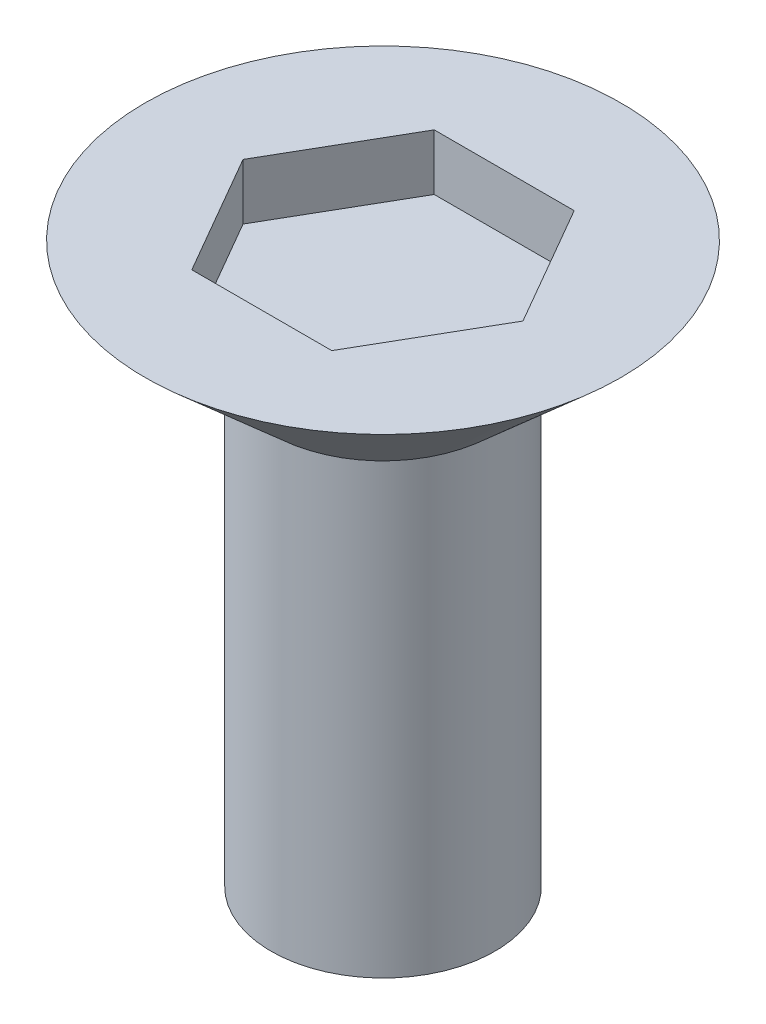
ISO-10303-21;
HEADER;
FILE_DESCRIPTION(('STEP AP214'),'2;1');
FILE_NAME('part.step','',(''),(''),'','','');
FILE_SCHEMA(('AUTOMOTIVE_DESIGN { 1 0 10303 214 1 1 1 1 }'));
ENDSEC;
DATA;
#1=APPLICATION_CONTEXT('core data for automotive mechanical design processes');
#2=APPLICATION_PROTOCOL_DEFINITION('international standard','automotive_design',2000,#1);
#3=PRODUCT_CONTEXT('',#1,'mechanical');
#4=PRODUCT('Part','Part','',(#3));
#5=PRODUCT_RELATED_PRODUCT_CATEGORY('part','',(#4));
#6=PRODUCT_DEFINITION_FORMATION('','',#4);
#7=PRODUCT_DEFINITION_CONTEXT('part definition',#1,'design');
#8=PRODUCT_DEFINITION('design','',#6,#7);
#9=PRODUCT_DEFINITION_SHAPE('','',#8);
#10=(LENGTH_UNIT() NAMED_UNIT(*) SI_UNIT(.MILLI.,.METRE.));
#11=(NAMED_UNIT(*) PLANE_ANGLE_UNIT() SI_UNIT($,.RADIAN.));
#12=(NAMED_UNIT(*) SI_UNIT($,.STERADIAN.) SOLID_ANGLE_UNIT());
#13=UNCERTAINTY_MEASURE_WITH_UNIT(LENGTH_MEASURE(1.E-05),#10,'distance_accuracy_value','');
#14=(GEOMETRIC_REPRESENTATION_CONTEXT(3) GLOBAL_UNCERTAINTY_ASSIGNED_CONTEXT((#13)) GLOBAL_UNIT_ASSIGNED_CONTEXT((#10,
#11,#12)) REPRESENTATION_CONTEXT('',''));
#15=CARTESIAN_POINT('',(0.,0.,0.));
#16=DIRECTION('',(0.,0.,1.));
#17=DIRECTION('',(1.,0.,0.));
#18=AXIS2_PLACEMENT_3D('',#15,#16,#17);
#19=CARTESIAN_POINT('',(0.,20.,0.));
#20=DIRECTION('',(0.,1.,0.));
#21=DIRECTION('',(-1.,0.,0.));
#22=AXIS2_PLACEMENT_3D('',#19,#20,#21);
#23=CONICAL_SURFACE('',#22,8.49999999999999,0.84415398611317);
#24=CARTESIAN_POINT('',(0.,16.,0.));
#25=DIRECTION('',(0.,1.,0.));
#26=DIRECTION('',(-1.,0.,0.));
#27=AXIS2_PLACEMENT_3D('',#24,#25,#26);
#28=CIRCLE('',#27,3.99999999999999);
#29=CARTESIAN_POINT('',(-4.,16.,0.));
#30=VERTEX_POINT('',#29);
#31=EDGE_CURVE('E131',#30,#30,#28,.T.);
#32=ORIENTED_EDGE('',*,*,#31,.T.);
#33=EDGE_LOOP('',(#32));
#34=FACE_BOUND('',#33,.T.);
#35=CARTESIAN_POINT('',(0.,20.,0.));
#36=DIRECTION('',(0.,1.,0.));
#37=DIRECTION('',(-1.,0.,0.));
#38=AXIS2_PLACEMENT_3D('',#35,#36,#37);
#39=CIRCLE('',#38,8.49999999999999);
#40=CARTESIAN_POINT('',(-8.5,20.,0.));
#41=VERTEX_POINT('',#40);
#42=EDGE_CURVE('E11',#41,#41,#39,.T.);
#43=ORIENTED_EDGE('',*,*,#42,.F.);
#44=EDGE_LOOP('',(#43));
#45=FACE_BOUND('',#44,.T.);
#46=ADVANCED_FACE('F30',(#34,#45),#23,.T.);
#47=CARTESIAN_POINT('',(-8.5,20.,0.));
#48=DIRECTION('',(0.,1.,0.));
#49=DIRECTION('',(-1.,0.,0.));
#50=AXIS2_PLACEMENT_3D('',#47,#48,#49);
#51=PLANE('',#50);
#52=DIRECTION('',(0.5,0.,0.866025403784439));
#53=VECTOR('',#52,1.);
#54=CARTESIAN_POINT('',(-2.50000000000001,20.,4.33012701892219));
#55=LINE('',#54,#53);
#56=CARTESIAN_POINT('',(-5.00000000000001,20.,0.));
#57=VERTEX_POINT('',#56);
#58=CARTESIAN_POINT('',(-2.50000000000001,20.,4.33012701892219));
#59=VERTEX_POINT('',#58);
#60=EDGE_CURVE('E44',#57,#59,#55,.T.);
#61=ORIENTED_EDGE('',*,*,#60,.F.);
#62=DIRECTION('',(-0.5,0.,0.866025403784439));
#63=VECTOR('',#62,1.);
#64=CARTESIAN_POINT('',(-5.00000000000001,20.,0.));
#65=LINE('',#64,#63);
#66=CARTESIAN_POINT('',(-2.50000000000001,20.,-4.33012701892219));
#67=VERTEX_POINT('',#66);
#68=EDGE_CURVE('E127',#67,#57,#65,.T.);
#69=ORIENTED_EDGE('',*,*,#68,.F.);
#70=DIRECTION('',(-1.,0.,0.));
#71=VECTOR('',#70,1.);
#72=CARTESIAN_POINT('',(-2.50000000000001,20.,-4.33012701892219));
#73=LINE('',#72,#71);
#74=CARTESIAN_POINT('',(2.49999999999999,20.,-4.33012701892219));
#75=VERTEX_POINT('',#74);
#76=EDGE_CURVE('E125',#75,#67,#73,.T.);
#77=ORIENTED_EDGE('',*,*,#76,.F.);
#78=DIRECTION('',(-0.5,0.,-0.866025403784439));
#79=VECTOR('',#78,1.);
#80=CARTESIAN_POINT('',(2.49999999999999,20.,-4.33012701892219));
#81=LINE('',#80,#79);
#82=CARTESIAN_POINT('',(4.99999999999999,20.,0.));
#83=VERTEX_POINT('',#82);
#84=EDGE_CURVE('E92',#83,#75,#81,.T.);
#85=ORIENTED_EDGE('',*,*,#84,.F.);
#86=DIRECTION('',(0.5,0.,-0.866025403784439));
#87=VECTOR('',#86,1.);
#88=CARTESIAN_POINT('',(4.99999999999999,20.,0.));
#89=LINE('',#88,#87);
#90=CARTESIAN_POINT('',(2.49999999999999,20.,4.33012701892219));
#91=VERTEX_POINT('',#90);
#92=EDGE_CURVE('E121',#91,#83,#89,.T.);
#93=ORIENTED_EDGE('',*,*,#92,.F.);
#94=DIRECTION('',(1.,0.,0.));
#95=VECTOR('',#94,1.);
#96=CARTESIAN_POINT('',(2.49999999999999,20.,4.33012701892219));
#97=LINE('',#96,#95);
#98=EDGE_CURVE('E118',#59,#91,#97,.T.);
#99=ORIENTED_EDGE('',*,*,#98,.F.);
#100=EDGE_LOOP('',(#61,#69,#77,#85,#93,#99));
#101=FACE_BOUND('',#100,.T.);
#102=ORIENTED_EDGE('',*,*,#42,.T.);
#103=EDGE_LOOP('',(#102));
#104=FACE_BOUND('',#103,.T.);
#105=ADVANCED_FACE('F146',(#101,#104),#51,.T.);
#106=CARTESIAN_POINT('',(-4.,0.,0.));
#107=DIRECTION('',(0.,-1.,0.));
#108=DIRECTION('',(1.,0.,0.));
#109=AXIS2_PLACEMENT_3D('',#106,#107,#108);
#110=PLANE('',#109);
#111=CARTESIAN_POINT('',(0.,0.,0.));
#112=DIRECTION('',(0.,1.,0.));
#113=DIRECTION('',(-1.,0.,0.));
#114=AXIS2_PLACEMENT_3D('',#111,#112,#113);
#115=CIRCLE('',#114,4.);
#116=CARTESIAN_POINT('',(-4.,0.,0.));
#117=VERTEX_POINT('',#116);
#118=EDGE_CURVE('E37',#117,#117,#115,.T.);
#119=ORIENTED_EDGE('',*,*,#118,.F.);
#120=EDGE_LOOP('',(#119));
#121=FACE_BOUND('',#120,.T.);
#122=ADVANCED_FACE('F144',(#121),#110,.T.);
#123=CARTESIAN_POINT('',(0.,20.,0.));
#124=DIRECTION('',(0.,1.,0.));
#125=DIRECTION('',(-1.,0.,0.));
#126=AXIS2_PLACEMENT_3D('',#123,#124,#125);
#127=CYLINDRICAL_SURFACE('',#126,4.);
#128=ORIENTED_EDGE('',*,*,#118,.T.);
#129=EDGE_LOOP('',(#128));
#130=FACE_BOUND('',#129,.T.);
#131=ORIENTED_EDGE('',*,*,#31,.F.);
#132=EDGE_LOOP('',(#131));
#133=FACE_BOUND('',#132,.T.);
#134=ADVANCED_FACE('F141',(#130,#133),#127,.T.);
#135=CARTESIAN_POINT('',(-2.50000000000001,18.,4.33012701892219));
#136=DIRECTION('',(-0.866025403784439,0.,0.5));
#137=DIRECTION('',(0.5,0.,0.866025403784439));
#138=AXIS2_PLACEMENT_3D('',#135,#136,#137);
#139=PLANE('',#138);
#140=ORIENTED_EDGE('',*,*,#60,.T.);
#141=DIRECTION('',(0.,1.,0.));
#142=VECTOR('',#141,1.);
#143=CARTESIAN_POINT('',(-2.50000000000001,18.,4.33012701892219));
#144=LINE('',#143,#142);
#145=CARTESIAN_POINT('',(-2.50000000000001,18.,4.33012701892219));
#146=VERTEX_POINT('',#145);
#147=EDGE_CURVE('E74',#146,#59,#144,.T.);
#148=ORIENTED_EDGE('',*,*,#147,.F.);
#149=DIRECTION('',(0.5,0.,0.866025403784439));
#150=VECTOR('',#149,1.);
#151=CARTESIAN_POINT('',(-2.50000000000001,18.,4.33012701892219));
#152=LINE('',#151,#150);
#153=CARTESIAN_POINT('',(-5.00000000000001,18.,0.));
#154=VERTEX_POINT('',#153);
#155=EDGE_CURVE('E129',#154,#146,#152,.T.);
#156=ORIENTED_EDGE('',*,*,#155,.F.);
#157=DIRECTION('',(0.,1.,0.));
#158=VECTOR('',#157,1.);
#159=CARTESIAN_POINT('',(-5.00000000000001,18.,0.));
#160=LINE('',#159,#158);
#161=EDGE_CURVE('E52',#154,#57,#160,.T.);
#162=ORIENTED_EDGE('',*,*,#161,.T.);
#163=EDGE_LOOP('',(#140,#148,#156,#162));
#164=FACE_BOUND('',#163,.T.);
#165=ADVANCED_FACE('F152',(#164),#139,.F.);
#166=CARTESIAN_POINT('',(-5.00000000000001,18.,0.));
#167=DIRECTION('',(-0.866025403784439,0.,-0.5));
#168=DIRECTION('',(-0.5,0.,0.866025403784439));
#169=AXIS2_PLACEMENT_3D('',#166,#167,#168);
#170=PLANE('',#169);
#171=ORIENTED_EDGE('',*,*,#68,.T.);
#172=ORIENTED_EDGE('',*,*,#161,.F.);
#173=DIRECTION('',(-0.5,0.,0.866025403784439));
#174=VECTOR('',#173,1.);
#175=CARTESIAN_POINT('',(-5.00000000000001,18.,0.));
#176=LINE('',#175,#174);
#177=CARTESIAN_POINT('',(-2.50000000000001,18.,-4.33012701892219));
#178=VERTEX_POINT('',#177);
#179=EDGE_CURVE('E104',#178,#154,#176,.T.);
#180=ORIENTED_EDGE('',*,*,#179,.F.);
#181=DIRECTION('',(0.,1.,0.));
#182=VECTOR('',#181,1.);
#183=CARTESIAN_POINT('',(-2.50000000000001,18.,-4.33012701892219));
#184=LINE('',#183,#182);
#185=EDGE_CURVE('E96',#178,#67,#184,.T.);
#186=ORIENTED_EDGE('',*,*,#185,.T.);
#187=EDGE_LOOP('',(#171,#172,#180,#186));
#188=FACE_BOUND('',#187,.T.);
#189=ADVANCED_FACE('F180',(#188),#170,.F.);
#190=CARTESIAN_POINT('',(-2.50000000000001,18.,-4.33012701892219));
#191=DIRECTION('',(0.,0.,-1.));
#192=DIRECTION('',(-1.,0.,0.));
#193=AXIS2_PLACEMENT_3D('',#190,#191,#192);
#194=PLANE('',#193);
#195=ORIENTED_EDGE('',*,*,#76,.T.);
#196=ORIENTED_EDGE('',*,*,#185,.F.);
#197=DIRECTION('',(-1.,0.,0.));
#198=VECTOR('',#197,1.);
#199=CARTESIAN_POINT('',(-2.50000000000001,18.,-4.33012701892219));
#200=LINE('',#199,#198);
#201=CARTESIAN_POINT('',(2.49999999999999,18.,-4.33012701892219));
#202=VERTEX_POINT('',#201);
#203=EDGE_CURVE('E100',#202,#178,#200,.T.);
#204=ORIENTED_EDGE('',*,*,#203,.F.);
#205=DIRECTION('',(0.,1.,0.));
#206=VECTOR('',#205,1.);
#207=CARTESIAN_POINT('',(2.49999999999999,18.,-4.33012701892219));
#208=LINE('',#207,#206);
#209=EDGE_CURVE('E85',#202,#75,#208,.T.);
#210=ORIENTED_EDGE('',*,*,#209,.T.);
#211=EDGE_LOOP('',(#195,#196,#204,#210));
#212=FACE_BOUND('',#211,.T.);
#213=ADVANCED_FACE('F101',(#212),#194,.F.);
#214=CARTESIAN_POINT('',(2.49999999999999,18.,-4.33012701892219));
#215=DIRECTION('',(0.866025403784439,0.,-0.5));
#216=DIRECTION('',(-0.5,0.,-0.866025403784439));
#217=AXIS2_PLACEMENT_3D('',#214,#215,#216);
#218=PLANE('',#217);
#219=ORIENTED_EDGE('',*,*,#84,.T.);
#220=ORIENTED_EDGE('',*,*,#209,.F.);
#221=DIRECTION('',(-0.5,0.,-0.866025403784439));
#222=VECTOR('',#221,1.);
#223=CARTESIAN_POINT('',(2.49999999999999,18.,-4.33012701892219));
#224=LINE('',#223,#222);
#225=CARTESIAN_POINT('',(4.99999999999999,18.,0.));
#226=VERTEX_POINT('',#225);
#227=EDGE_CURVE('E89',#226,#202,#224,.T.);
#228=ORIENTED_EDGE('',*,*,#227,.F.);
#229=DIRECTION('',(0.,1.,0.));
#230=VECTOR('',#229,1.);
#231=CARTESIAN_POINT('',(4.99999999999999,18.,0.));
#232=LINE('',#231,#230);
#233=EDGE_CURVE('E97',#226,#83,#232,.T.);
#234=ORIENTED_EDGE('',*,*,#233,.T.);
#235=EDGE_LOOP('',(#219,#220,#228,#234));
#236=FACE_BOUND('',#235,.T.);
#237=ADVANCED_FACE('F87',(#236),#218,.F.);
#238=CARTESIAN_POINT('',(4.99999999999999,18.,0.));
#239=DIRECTION('',(0.866025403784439,0.,0.5));
#240=DIRECTION('',(0.5,0.,-0.866025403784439));
#241=AXIS2_PLACEMENT_3D('',#238,#239,#240);
#242=PLANE('',#241);
#243=ORIENTED_EDGE('',*,*,#92,.T.);
#244=ORIENTED_EDGE('',*,*,#233,.F.);
#245=DIRECTION('',(0.5,0.,-0.866025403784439));
#246=VECTOR('',#245,1.);
#247=CARTESIAN_POINT('',(4.99999999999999,18.,0.));
#248=LINE('',#247,#246);
#249=CARTESIAN_POINT('',(2.49999999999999,18.,4.33012701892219));
#250=VERTEX_POINT('',#249);
#251=EDGE_CURVE('E110',#250,#226,#248,.T.);
#252=ORIENTED_EDGE('',*,*,#251,.F.);
#253=DIRECTION('',(0.,1.,0.));
#254=VECTOR('',#253,1.);
#255=CARTESIAN_POINT('',(2.49999999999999,18.,4.33012701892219));
#256=LINE('',#255,#254);
#257=EDGE_CURVE('E134',#250,#91,#256,.T.);
#258=ORIENTED_EDGE('',*,*,#257,.T.);
#259=EDGE_LOOP('',(#243,#244,#252,#258));
#260=FACE_BOUND('',#259,.T.);
#261=ADVANCED_FACE('F205',(#260),#242,.F.);
#262=CARTESIAN_POINT('',(2.49999999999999,18.,4.33012701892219));
#263=DIRECTION('',(0.,0.,1.));
#264=DIRECTION('',(1.,0.,0.));
#265=AXIS2_PLACEMENT_3D('',#262,#263,#264);
#266=PLANE('',#265);
#267=ORIENTED_EDGE('',*,*,#98,.T.);
#268=ORIENTED_EDGE('',*,*,#257,.F.);
#269=DIRECTION('',(1.,0.,0.));
#270=VECTOR('',#269,1.);
#271=CARTESIAN_POINT('',(2.49999999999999,18.,4.33012701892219));
#272=LINE('',#271,#270);
#273=EDGE_CURVE('E112',#146,#250,#272,.T.);
#274=ORIENTED_EDGE('',*,*,#273,.F.);
#275=ORIENTED_EDGE('',*,*,#147,.T.);
#276=EDGE_LOOP('',(#267,#268,#274,#275));
#277=FACE_BOUND('',#276,.T.);
#278=ADVANCED_FACE('F214',(#277),#266,.F.);
#279=CARTESIAN_POINT('',(-5.00000000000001,18.,0.));
#280=DIRECTION('',(0.,-1.,0.));
#281=DIRECTION('',(0.,0.,-1.));
#282=AXIS2_PLACEMENT_3D('',#279,#280,#281);
#283=PLANE('',#282);
#284=ORIENTED_EDGE('',*,*,#155,.T.);
#285=ORIENTED_EDGE('',*,*,#273,.T.);
#286=ORIENTED_EDGE('',*,*,#251,.T.);
#287=ORIENTED_EDGE('',*,*,#227,.T.);
#288=ORIENTED_EDGE('',*,*,#203,.T.);
#289=ORIENTED_EDGE('',*,*,#179,.T.);
#290=EDGE_LOOP('',(#284,#285,#286,#287,#288,#289));
#291=FACE_BOUND('',#290,.T.);
#292=ADVANCED_FACE('F107',(#291),#283,.F.);
#293=CLOSED_SHELL('',(#46,#105,#122,#134,#165,#189,#213,#237,#261,#278,#292));
#294=MANIFOLD_SOLID_BREP('B2',#293);
#295=ADVANCED_BREP_SHAPE_REPRESENTATION('',(#18,#294),#14);
#296=SHAPE_DEFINITION_REPRESENTATION(#9,#295);
ENDSEC;
END-ISO-10303-21;
